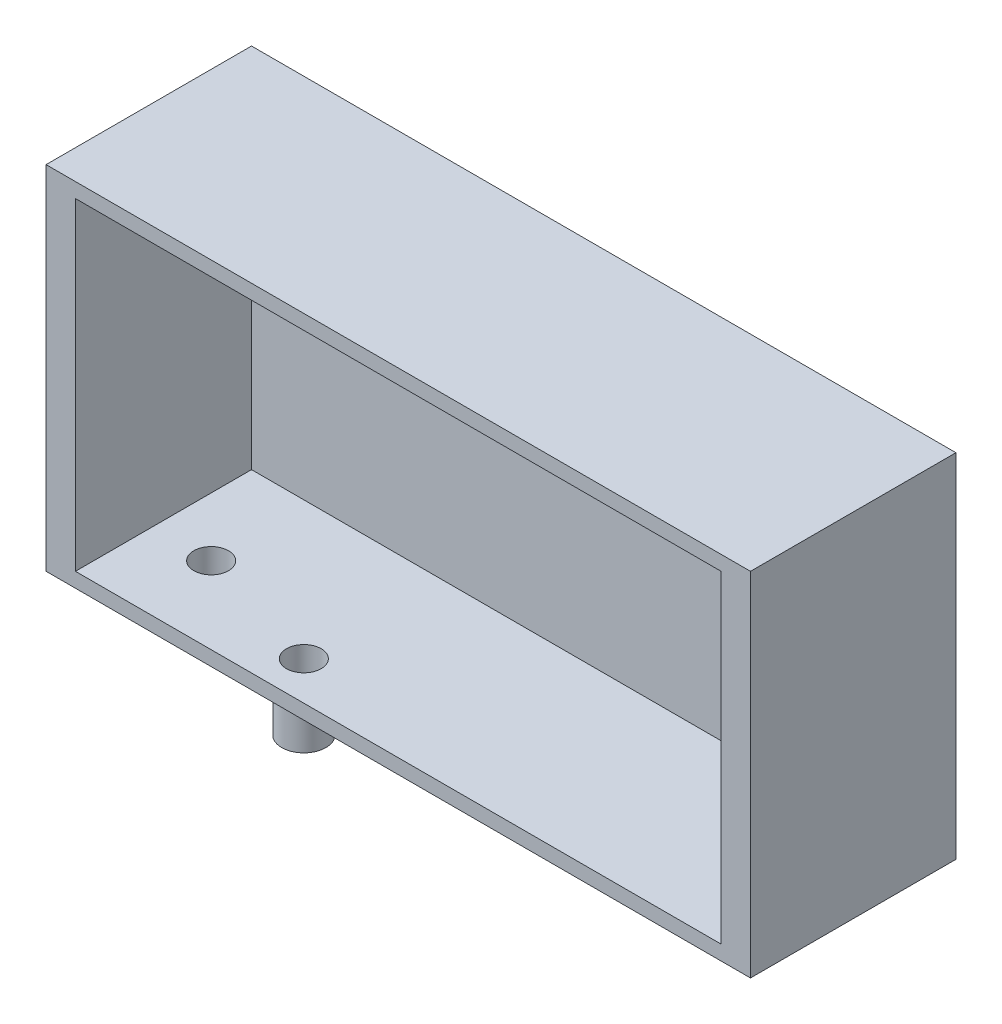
from build123d import *

# Parameters (mm, degrees)
SKETCH1_W           = 2438.4
SKETCH1_H           = 1219.2
BOSS_EXTRUDE1_DEPTH = 711.2
SKETCH2_W           = 2235.2
SKETCH2_H           = 1117.6
CUT_EXTRUDE1_DEPTH  = 609.6
SKETCH4_R           = 76.2
BOSS_EXTRUDE2_DEPTH = 177.8
SKETCH5_R           = 60.071
CUT_EXTRUDE2_DEPTH  = 228.6


with BuildPart() as part:
    # Sketch1 → Boss-Extrude1 (new body)
    with BuildSketch(Plane.XY):
        with Locations((1219.2, 609.6)):
            Rectangle(SKETCH1_W, SKETCH1_H)
    extrude(amount=BOSS_EXTRUDE1_DEPTH)

    # Sketch2 → Cut-Extrude1 (cut)
    with BuildSketch(Plane.XY.offset(711.2)):
        with Locations((1219.2, 609.6)):
            Rectangle(SKETCH2_W, SKETCH2_H)
    extrude(amount=-CUT_EXTRUDE1_DEPTH, mode=Mode.SUBTRACT)

    # Sketch4 → Boss-Extrude2 (add)
    with BuildSketch(Plane.XZ):
        with Locations(Location((304.8, 444.5, 0), (0, 0, 90))):
            Circle(SKETCH4_R)
        with Locations(Location((758.952, 577.85, 0), (0, 0, 90))):
            Circle(SKETCH4_R)
    extrude(amount=BOSS_EXTRUDE2_DEPTH)

    # Sketch5 → Cut-Extrude2 (cut)
    with BuildSketch(Plane.XZ.offset(177.8)):
        with Locations(Location((304.8, 444.5, 0), (0, 0, 270))):
            Circle(SKETCH5_R)
        with Locations(Location((758.952, 577.85, 0), (0, 0, 270))):
            Circle(SKETCH5_R)
    extrude(amount=-CUT_EXTRUDE2_DEPTH, mode=Mode.SUBTRACT)


solid = part.part
